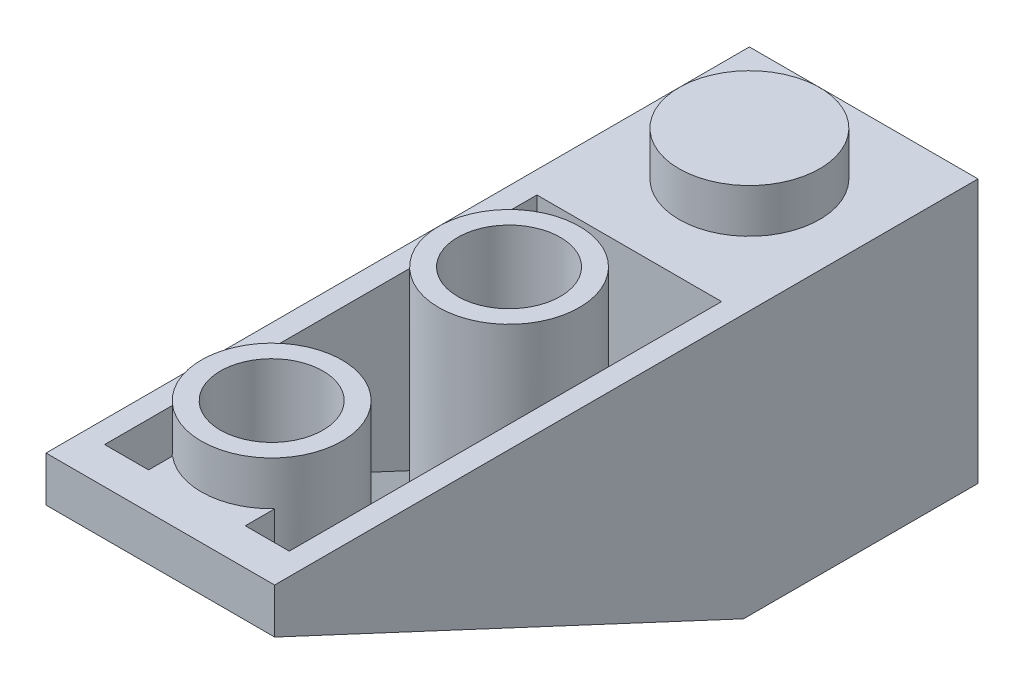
ISO-10303-21;
HEADER;
FILE_DESCRIPTION(('STEP AP214'),'2;1');
FILE_NAME('part.step','',(''),(''),'','','');
FILE_SCHEMA(('AUTOMOTIVE_DESIGN { 1 0 10303 214 1 1 1 1 }'));
ENDSEC;
DATA;
#1=APPLICATION_CONTEXT('core data for automotive mechanical design processes');
#2=APPLICATION_PROTOCOL_DEFINITION('international standard','automotive_design',2000,#1);
#3=PRODUCT_CONTEXT('',#1,'mechanical');
#4=PRODUCT('Part','Part','',(#3));
#5=PRODUCT_RELATED_PRODUCT_CATEGORY('part','',(#4));
#6=PRODUCT_DEFINITION_FORMATION('','',#4);
#7=PRODUCT_DEFINITION_CONTEXT('part definition',#1,'design');
#8=PRODUCT_DEFINITION('design','',#6,#7);
#9=PRODUCT_DEFINITION_SHAPE('','',#8);
#10=(LENGTH_UNIT() NAMED_UNIT(*) SI_UNIT(.MILLI.,.METRE.));
#11=(NAMED_UNIT(*) PLANE_ANGLE_UNIT() SI_UNIT($,.RADIAN.));
#12=(NAMED_UNIT(*) SI_UNIT($,.STERADIAN.) SOLID_ANGLE_UNIT());
#13=UNCERTAINTY_MEASURE_WITH_UNIT(LENGTH_MEASURE(1.E-05),#10,'distance_accuracy_value','');
#14=(GEOMETRIC_REPRESENTATION_CONTEXT(3) GLOBAL_UNCERTAINTY_ASSIGNED_CONTEXT((#13)) GLOBAL_UNIT_ASSIGNED_CONTEXT((#10,
#11,#12)) REPRESENTATION_CONTEXT('',''));
#15=CARTESIAN_POINT('',(0.,0.,0.));
#16=DIRECTION('',(0.,0.,1.));
#17=DIRECTION('',(1.,0.,0.));
#18=AXIS2_PLACEMENT_3D('',#15,#16,#17);
#19=CARTESIAN_POINT('',(-7.8,0.,24.));
#20=DIRECTION('',(0.,1.,0.));
#21=DIRECTION('',(0.,0.,1.));
#22=AXIS2_PLACEMENT_3D('',#19,#20,#21);
#23=PLANE('',#22);
#24=DIRECTION('',(0.,0.,1.));
#25=VECTOR('',#24,1.);
#26=CARTESIAN_POINT('',(-0.75,0.,24.));
#27=LINE('',#26,#25);
#28=CARTESIAN_POINT('',(-0.75,0.,8.));
#29=VERTEX_POINT('',#28);
#30=CARTESIAN_POINT('',(-0.75,0.,22.75));
#31=VERTEX_POINT('',#30);
#32=EDGE_CURVE('E189',#29,#31,#27,.T.);
#33=ORIENTED_EDGE('',*,*,#32,.T.);
#34=DIRECTION('',(-1.,0.,0.));
#35=VECTOR('',#34,1.);
#36=CARTESIAN_POINT('',(-7.05,0.,22.75));
#37=LINE('',#36,#35);
#38=CARTESIAN_POINT('',(-2.25,0.,22.75));
#39=VERTEX_POINT('',#38);
#40=EDGE_CURVE('E52',#31,#39,#37,.T.);
#41=ORIENTED_EDGE('',*,*,#40,.T.);
#42=DIRECTION('',(0.,0.,-1.));
#43=VECTOR('',#42,1.);
#44=CARTESIAN_POINT('',(-2.25,0.,21.7609382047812));
#45=LINE('',#44,#43);
#46=CARTESIAN_POINT('',(-2.25,0.,21.7609382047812));
#47=VERTEX_POINT('',#46);
#48=EDGE_CURVE('E301',#39,#47,#45,.T.);
#49=ORIENTED_EDGE('',*,*,#48,.T.);
#50=DIRECTION('',(-1.,0.,0.));
#51=VECTOR('',#50,1.);
#52=CARTESIAN_POINT('',(-2.25,0.,21.7609382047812));
#53=LINE('',#52,#51);
#54=CARTESIAN_POINT('',(-2.26757849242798,0.,21.7609382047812));
#55=VERTEX_POINT('',#54);
#56=EDGE_CURVE('E57',#47,#55,#53,.T.);
#57=ORIENTED_EDGE('',*,*,#56,.T.);
#58=CARTESIAN_POINT('',(-4.,0.,20.1));
#59=DIRECTION('',(0.,-1.,0.));
#60=DIRECTION('',(0.,0.,-1.));
#61=AXIS2_PLACEMENT_3D('',#58,#59,#60);
#62=CIRCLE('',#61,2.4);
#63=CARTESIAN_POINT('',(-5.55,0.,21.9323482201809));
#64=VERTEX_POINT('',#63);
#65=EDGE_CURVE('E312',#64,#55,#62,.F.);
#66=ORIENTED_EDGE('',*,*,#65,.F.);
#67=DIRECTION('',(0.,0.,1.));
#68=VECTOR('',#67,1.);
#69=CARTESIAN_POINT('',(-5.55,0.,21.7609382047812));
#70=LINE('',#69,#68);
#71=CARTESIAN_POINT('',(-5.55,0.,22.75));
#72=VERTEX_POINT('',#71);
#73=EDGE_CURVE('E275',#64,#72,#70,.T.);
#74=ORIENTED_EDGE('',*,*,#73,.T.);
#75=CARTESIAN_POINT('',(-7.05,0.,22.75));
#76=VERTEX_POINT('',#75);
#77=EDGE_CURVE('E182',#72,#76,#37,.T.);
#78=ORIENTED_EDGE('',*,*,#77,.T.);
#79=DIRECTION('',(0.,0.,-1.));
#80=VECTOR('',#79,1.);
#81=CARTESIAN_POINT('',(-7.05,0.,24.));
#82=LINE('',#81,#80);
#83=CARTESIAN_POINT('',(-7.05,0.,8.));
#84=VERTEX_POINT('',#83);
#85=EDGE_CURVE('E366',#76,#84,#82,.T.);
#86=ORIENTED_EDGE('',*,*,#85,.T.);
#87=DIRECTION('',(1.,0.,0.));
#88=VECTOR('',#87,1.);
#89=CARTESIAN_POINT('',(-7.8,0.,8.));
#90=LINE('',#89,#88);
#91=EDGE_CURVE('E196',#84,#29,#90,.T.);
#92=ORIENTED_EDGE('',*,*,#91,.T.);
#93=EDGE_LOOP('',(#33,#41,#49,#57,#66,#74,#78,#86,#92));
#94=FACE_BOUND('',#93,.T.);
#95=DIRECTION('',(0.,0.,1.));
#96=VECTOR('',#95,1.);
#97=CARTESIAN_POINT('',(-7.8,0.,8.));
#98=LINE('',#97,#96);
#99=CARTESIAN_POINT('',(-7.8,0.,0.));
#100=VERTEX_POINT('',#99);
#101=CARTESIAN_POINT('',(-7.8,0.,24.));
#102=VERTEX_POINT('',#101);
#103=EDGE_CURVE('E210',#100,#102,#98,.T.);
#104=ORIENTED_EDGE('',*,*,#103,.T.);
#105=DIRECTION('',(1.,0.,0.));
#106=VECTOR('',#105,1.);
#107=CARTESIAN_POINT('',(-7.8,0.,24.));
#108=LINE('',#107,#106);
#109=CARTESIAN_POINT('',(0.,0.,24.));
#110=VERTEX_POINT('',#109);
#111=EDGE_CURVE('E243',#102,#110,#108,.T.);
#112=ORIENTED_EDGE('',*,*,#111,.T.);
#113=DIRECTION('',(0.,0.,1.));
#114=VECTOR('',#113,1.);
#115=CARTESIAN_POINT('',(0.,0.,24.));
#116=LINE('',#115,#114);
#117=CARTESIAN_POINT('',(0.,0.,0.));
#118=VERTEX_POINT('',#117);
#119=EDGE_CURVE('E225',#118,#110,#116,.T.);
#120=ORIENTED_EDGE('',*,*,#119,.F.);
#121=DIRECTION('',(1.,0.,0.));
#122=VECTOR('',#121,1.);
#123=CARTESIAN_POINT('',(-7.8,0.,0.));
#124=LINE('',#123,#122);
#125=EDGE_CURVE('E222',#100,#118,#124,.T.);
#126=ORIENTED_EDGE('',*,*,#125,.F.);
#127=EDGE_LOOP('',(#104,#112,#120,#126));
#128=FACE_BOUND('',#127,.T.);
#129=CARTESIAN_POINT('',(-3.9,0.,3.9));
#130=DIRECTION('',(0.,1.,0.));
#131=DIRECTION('',(0.,0.,1.));
#132=AXIS2_PLACEMENT_3D('',#129,#130,#131);
#133=CIRCLE('',#132,2.4);
#134=CARTESIAN_POINT('',(-3.9,0.,6.3));
#135=VERTEX_POINT('',#134);
#136=EDGE_CURVE('E334',#135,#135,#133,.T.);
#137=ORIENTED_EDGE('',*,*,#136,.F.);
#138=EDGE_LOOP('',(#137));
#139=FACE_BOUND('',#138,.T.);
#140=ADVANCED_FACE('F37',(#94,#128,#139),#23,.T.);
#141=CARTESIAN_POINT('',(-7.8,-8.00000000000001,8.));
#142=DIRECTION('',(0.,0.90630778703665,-0.422618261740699));
#143=DIRECTION('',(0.,0.422618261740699,0.90630778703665));
#144=AXIS2_PLACEMENT_3D('',#141,#142,#143);
#145=PLANE('',#144);
#146=DIRECTION('',(1.,0.,0.));
#147=VECTOR('',#146,1.);
#148=CARTESIAN_POINT('',(-7.05,-1.12196204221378,22.75));
#149=LINE('',#148,#147);
#150=CARTESIAN_POINT('',(-2.25,-1.12196204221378,22.75));
#151=VERTEX_POINT('',#150);
#152=CARTESIAN_POINT('',(-0.75,-1.12196204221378,22.75));
#153=VERTEX_POINT('',#152);
#154=EDGE_CURVE('E382',#151,#153,#149,.T.);
#155=ORIENTED_EDGE('',*,*,#154,.T.);
#156=DIRECTION('',(0.,-0.422618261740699,-0.90630778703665));
#157=VECTOR('',#156,1.);
#158=CARTESIAN_POINT('',(-0.75,-8.00000000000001,8.));
#159=LINE('',#158,#157);
#160=CARTESIAN_POINT('',(-0.75,-8.00000000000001,8.));
#161=VERTEX_POINT('',#160);
#162=EDGE_CURVE('E191',#153,#161,#159,.T.);
#163=ORIENTED_EDGE('',*,*,#162,.T.);
#164=DIRECTION('',(1.,0.,0.));
#165=VECTOR('',#164,1.);
#166=CARTESIAN_POINT('',(-7.8,-8.00000000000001,8.));
#167=LINE('',#166,#165);
#168=CARTESIAN_POINT('',(-7.05,-8.00000000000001,8.));
#169=VERTEX_POINT('',#168);
#170=EDGE_CURVE('E245',#169,#161,#167,.T.);
#171=ORIENTED_EDGE('',*,*,#170,.F.);
#172=DIRECTION('',(0.,-0.422618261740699,-0.90630778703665));
#173=VECTOR('',#172,1.);
#174=CARTESIAN_POINT('',(-7.05,-8.00000000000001,8.));
#175=LINE('',#174,#173);
#176=CARTESIAN_POINT('',(-7.05,-1.12196204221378,22.75));
#177=VERTEX_POINT('',#176);
#178=EDGE_CURVE('E198',#177,#169,#175,.T.);
#179=ORIENTED_EDGE('',*,*,#178,.F.);
#180=CARTESIAN_POINT('',(-5.55,-1.12196204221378,22.75));
#181=VERTEX_POINT('',#180);
#182=EDGE_CURVE('E291',#177,#181,#149,.T.);
#183=ORIENTED_EDGE('',*,*,#182,.T.);
#184=DIRECTION('',(0.,-0.422618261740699,-0.90630778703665));
#185=VECTOR('',#184,1.);
#186=CARTESIAN_POINT('',(-5.55,-2.21627286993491,20.4032428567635));
#187=LINE('',#186,#185);
#188=CARTESIAN_POINT('',(-5.55,-1.50323932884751,21.9323482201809));
#189=VERTEX_POINT('',#188);
#190=EDGE_CURVE('E273',#181,#189,#187,.T.);
#191=ORIENTED_EDGE('',*,*,#190,.T.);
#192=CARTESIAN_POINT('',(-4.,-2.35767733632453,20.1));
#193=DIRECTION('',(0.,0.90630778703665,-0.422618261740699));
#194=DIRECTION('',(0.,0.422618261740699,0.90630778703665));
#195=AXIS2_PLACEMENT_3D('',#192,#193,#194);
#196=ELLIPSE('',#195,2.64810700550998,2.4);
#197=CARTESIAN_POINT('',(-2.26757849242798,-1.58316913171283,21.7609382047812));
#198=VERTEX_POINT('',#197);
#199=EDGE_CURVE('E252',#198,#189,#196,.T.);
#200=ORIENTED_EDGE('',*,*,#199,.F.);
#201=DIRECTION('',(1.,0.,0.));
#202=VECTOR('',#201,1.);
#203=CARTESIAN_POINT('',(-2.25,-1.58316913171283,21.7609382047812));
#204=LINE('',#203,#202);
#205=CARTESIAN_POINT('',(-2.25,-1.58316913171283,21.7609382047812));
#206=VERTEX_POINT('',#205);
#207=EDGE_CURVE('E288',#198,#206,#204,.T.);
#208=ORIENTED_EDGE('',*,*,#207,.T.);
#209=DIRECTION('',(0.,0.422618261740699,0.90630778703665));
#210=VECTOR('',#209,1.);
#211=CARTESIAN_POINT('',(-2.25,-2.21627286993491,20.4032428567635));
#212=LINE('',#211,#210);
#213=EDGE_CURVE('E296',#206,#151,#212,.T.);
#214=ORIENTED_EDGE('',*,*,#213,.T.);
#215=EDGE_LOOP('',(#155,#163,#171,#179,#183,#191,#200,#208,#214));
#216=FACE_BOUND('',#215,.T.);
#217=CARTESIAN_POINT('',(-3.9,-6.08784714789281,12.100625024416));
#218=DIRECTION('',(0.,0.90630778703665,-0.422618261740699));
#219=DIRECTION('',(0.,0.422618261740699,0.90630778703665));
#220=AXIS2_PLACEMENT_3D('',#217,#218,#219);
#221=ELLIPSE('',#220,2.64810700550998,2.4);
#222=CARTESIAN_POINT('',(-3.9,-4.96870876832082,14.500625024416));
#223=VERTEX_POINT('',#222);
#224=EDGE_CURVE('E238',#223,#223,#221,.T.);
#225=ORIENTED_EDGE('',*,*,#224,.F.);
#226=EDGE_LOOP('',(#225));
#227=FACE_BOUND('',#226,.T.);
#228=ADVANCED_FACE('F285',(#216,#227),#145,.T.);
#229=CARTESIAN_POINT('',(-7.8,-8.00000000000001,8.));
#230=DIRECTION('',(0.,0.,1.));
#231=DIRECTION('',(0.,-1.,0.));
#232=AXIS2_PLACEMENT_3D('',#229,#230,#231);
#233=PLANE('',#232);
#234=DIRECTION('',(0.,1.,0.));
#235=VECTOR('',#234,1.);
#236=CARTESIAN_POINT('',(-7.05,-8.00000000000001,8.));
#237=LINE('',#236,#235);
#238=EDGE_CURVE('E201',#169,#84,#237,.T.);
#239=ORIENTED_EDGE('',*,*,#238,.F.);
#240=ORIENTED_EDGE('',*,*,#170,.T.);
#241=DIRECTION('',(0.,1.,0.));
#242=VECTOR('',#241,1.);
#243=CARTESIAN_POINT('',(-0.75,-8.00000000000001,8.));
#244=LINE('',#243,#242);
#245=EDGE_CURVE('E197',#161,#29,#244,.T.);
#246=ORIENTED_EDGE('',*,*,#245,.T.);
#247=ORIENTED_EDGE('',*,*,#91,.F.);
#248=EDGE_LOOP('',(#239,#240,#246,#247));
#249=FACE_BOUND('',#248,.T.);
#250=ADVANCED_FACE('F381',(#249),#233,.T.);
#251=CARTESIAN_POINT('',(-7.8,0.,0.));
#252=DIRECTION('',(0.,0.,-1.));
#253=DIRECTION('',(0.,1.,0.));
#254=AXIS2_PLACEMENT_3D('',#251,#252,#253);
#255=PLANE('',#254);
#256=DIRECTION('',(0.,1.,0.));
#257=VECTOR('',#256,1.);
#258=CARTESIAN_POINT('',(0.,0.,0.));
#259=LINE('',#258,#257);
#260=CARTESIAN_POINT('',(0.,-9.,0.));
#261=VERTEX_POINT('',#260);
#262=EDGE_CURVE('E206',#261,#118,#259,.T.);
#263=ORIENTED_EDGE('',*,*,#262,.F.);
#264=DIRECTION('',(1.,0.,0.));
#265=VECTOR('',#264,1.);
#266=CARTESIAN_POINT('',(-7.8,-9.,0.));
#267=LINE('',#266,#265);
#268=CARTESIAN_POINT('',(-7.8,-9.,0.));
#269=VERTEX_POINT('',#268);
#270=EDGE_CURVE('E236',#269,#261,#267,.T.);
#271=ORIENTED_EDGE('',*,*,#270,.F.);
#272=DIRECTION('',(0.,1.,0.));
#273=VECTOR('',#272,1.);
#274=CARTESIAN_POINT('',(-7.8,0.,0.));
#275=LINE('',#274,#273);
#276=EDGE_CURVE('E207',#269,#100,#275,.T.);
#277=ORIENTED_EDGE('',*,*,#276,.T.);
#278=ORIENTED_EDGE('',*,*,#125,.T.);
#279=EDGE_LOOP('',(#263,#271,#277,#278));
#280=FACE_BOUND('',#279,.T.);
#281=ADVANCED_FACE('F39',(#280),#255,.T.);
#282=CARTESIAN_POINT('',(-7.8,-9.,0.));
#283=DIRECTION('',(0.,-1.,0.));
#284=DIRECTION('',(0.,0.,-1.));
#285=AXIS2_PLACEMENT_3D('',#282,#283,#284);
#286=PLANE('',#285);
#287=DIRECTION('',(0.,0.,1.));
#288=VECTOR('',#287,1.);
#289=CARTESIAN_POINT('',(-1.45,-9.,6.55));
#290=LINE('',#289,#288);
#291=CARTESIAN_POINT('',(-1.45,-9.,1.45));
#292=VERTEX_POINT('',#291);
#293=CARTESIAN_POINT('',(-1.45,-9.,6.55));
#294=VERTEX_POINT('',#293);
#295=EDGE_CURVE('E338',#292,#294,#290,.T.);
#296=ORIENTED_EDGE('',*,*,#295,.F.);
#297=DIRECTION('',(1.,0.,0.));
#298=VECTOR('',#297,1.);
#299=CARTESIAN_POINT('',(-1.45,-9.,1.45));
#300=LINE('',#299,#298);
#301=CARTESIAN_POINT('',(-6.35,-9.,1.45));
#302=VERTEX_POINT('',#301);
#303=EDGE_CURVE('E345',#302,#292,#300,.T.);
#304=ORIENTED_EDGE('',*,*,#303,.F.);
#305=DIRECTION('',(0.,0.,-1.));
#306=VECTOR('',#305,1.);
#307=CARTESIAN_POINT('',(-6.35,-9.,6.55));
#308=LINE('',#307,#306);
#309=CARTESIAN_POINT('',(-6.35,-9.,6.55));
#310=VERTEX_POINT('',#309);
#311=EDGE_CURVE('E359',#310,#302,#308,.T.);
#312=ORIENTED_EDGE('',*,*,#311,.F.);
#313=DIRECTION('',(-1.,0.,0.));
#314=VECTOR('',#313,1.);
#315=CARTESIAN_POINT('',(-1.45,-9.,6.55));
#316=LINE('',#315,#314);
#317=EDGE_CURVE('E356',#294,#310,#316,.T.);
#318=ORIENTED_EDGE('',*,*,#317,.F.);
#319=EDGE_LOOP('',(#296,#304,#312,#318));
#320=FACE_BOUND('',#319,.T.);
#321=DIRECTION('',(0.,0.,-1.));
#322=VECTOR('',#321,1.);
#323=CARTESIAN_POINT('',(0.,-9.,0.));
#324=LINE('',#323,#322);
#325=CARTESIAN_POINT('',(0.,-9.,8.));
#326=VERTEX_POINT('',#325);
#327=EDGE_CURVE('E211',#326,#261,#324,.T.);
#328=ORIENTED_EDGE('',*,*,#327,.F.);
#329=DIRECTION('',(1.,0.,0.));
#330=VECTOR('',#329,1.);
#331=CARTESIAN_POINT('',(-7.8,-9.,8.));
#332=LINE('',#331,#330);
#333=CARTESIAN_POINT('',(-7.8,-9.,8.));
#334=VERTEX_POINT('',#333);
#335=EDGE_CURVE('E239',#334,#326,#332,.T.);
#336=ORIENTED_EDGE('',*,*,#335,.F.);
#337=DIRECTION('',(0.,0.,-1.));
#338=VECTOR('',#337,1.);
#339=CARTESIAN_POINT('',(-7.8,-9.,0.));
#340=LINE('',#339,#338);
#341=EDGE_CURVE('E219',#334,#269,#340,.T.);
#342=ORIENTED_EDGE('',*,*,#341,.T.);
#343=ORIENTED_EDGE('',*,*,#270,.T.);
#344=EDGE_LOOP('',(#328,#336,#342,#343));
#345=FACE_BOUND('',#344,.T.);
#346=ADVANCED_FACE('F411',(#320,#345),#286,.T.);
#347=CARTESIAN_POINT('',(-7.8,-9.,8.));
#348=DIRECTION('',(0.,-0.90630778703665,0.422618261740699));
#349=DIRECTION('',(0.,-0.422618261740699,-0.90630778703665));
#350=AXIS2_PLACEMENT_3D('',#347,#348,#349);
#351=PLANE('',#350);
#352=CARTESIAN_POINT('',(-3.9,-7.13476936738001,12.));
#353=DIRECTION('',(0.,-0.90630778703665,0.422618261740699));
#354=DIRECTION('',(0.,-0.422618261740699,-0.90630778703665));
#355=AXIS2_PLACEMENT_3D('',#352,#353,#354);
#356=ELLIPSE('',#355,2.64810700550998,2.4);
#357=CARTESIAN_POINT('',(-6.16859773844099,-7.5,11.2167603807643));
#358=VERTEX_POINT('',#357);
#359=CARTESIAN_POINT('',(-1.63140226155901,-7.5,11.2167603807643));
#360=VERTEX_POINT('',#359);
#361=EDGE_CURVE('E258',#358,#360,#356,.T.);
#362=ORIENTED_EDGE('',*,*,#361,.F.);
#363=DIRECTION('',(1.,0.,0.));
#364=VECTOR('',#363,1.);
#365=CARTESIAN_POINT('',(-7.8,-7.5,11.2167603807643));
#366=LINE('',#365,#364);
#367=EDGE_CURVE('E255',#358,#360,#366,.T.);
#368=ORIENTED_EDGE('',*,*,#367,.T.);
#369=EDGE_LOOP('',(#362,#368));
#370=FACE_BOUND('',#369,.T.);
#371=DIRECTION('',(0.,-0.422618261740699,-0.90630778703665));
#372=VECTOR('',#371,1.);
#373=CARTESIAN_POINT('',(0.,-9.,8.));
#374=LINE('',#373,#372);
#375=CARTESIAN_POINT('',(0.,-1.53907746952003,24.));
#376=VERTEX_POINT('',#375);
#377=EDGE_CURVE('E231',#376,#326,#374,.T.);
#378=ORIENTED_EDGE('',*,*,#377,.F.);
#379=DIRECTION('',(1.,0.,0.));
#380=VECTOR('',#379,1.);
#381=CARTESIAN_POINT('',(-7.8,-1.53907746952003,24.));
#382=LINE('',#381,#380);
#383=CARTESIAN_POINT('',(-7.8,-1.53907746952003,24.));
#384=VERTEX_POINT('',#383);
#385=EDGE_CURVE('E241',#384,#376,#382,.T.);
#386=ORIENTED_EDGE('',*,*,#385,.F.);
#387=DIRECTION('',(0.,-0.422618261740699,-0.90630778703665));
#388=VECTOR('',#387,1.);
#389=CARTESIAN_POINT('',(-7.8,-9.,8.));
#390=LINE('',#389,#388);
#391=EDGE_CURVE('E216',#384,#334,#390,.T.);
#392=ORIENTED_EDGE('',*,*,#391,.T.);
#393=ORIENTED_EDGE('',*,*,#335,.T.);
#394=EDGE_LOOP('',(#378,#386,#392,#393));
#395=FACE_BOUND('',#394,.T.);
#396=ADVANCED_FACE('F416',(#370,#395),#351,.T.);
#397=CARTESIAN_POINT('',(-7.8,0.,24.));
#398=DIRECTION('',(0.,0.,1.));
#399=DIRECTION('',(1.,0.,0.));
#400=AXIS2_PLACEMENT_3D('',#397,#398,#399);
#401=PLANE('',#400);
#402=DIRECTION('',(0.,-1.,0.));
#403=VECTOR('',#402,1.);
#404=CARTESIAN_POINT('',(0.,0.,24.));
#405=LINE('',#404,#403);
#406=EDGE_CURVE('E228',#110,#376,#405,.T.);
#407=ORIENTED_EDGE('',*,*,#406,.F.);
#408=ORIENTED_EDGE('',*,*,#111,.F.);
#409=DIRECTION('',(0.,-1.,0.));
#410=VECTOR('',#409,1.);
#411=CARTESIAN_POINT('',(-7.8,0.,24.));
#412=LINE('',#411,#410);
#413=EDGE_CURVE('E213',#102,#384,#412,.T.);
#414=ORIENTED_EDGE('',*,*,#413,.T.);
#415=ORIENTED_EDGE('',*,*,#385,.T.);
#416=EDGE_LOOP('',(#407,#408,#414,#415));
#417=FACE_BOUND('',#416,.T.);
#418=ADVANCED_FACE('F405',(#417),#401,.T.);
#419=CARTESIAN_POINT('',(-7.8,0.,0.));
#420=DIRECTION('',(1.,0.,0.));
#421=DIRECTION('',(0.,0.,-1.));
#422=AXIS2_PLACEMENT_3D('',#419,#420,#421);
#423=PLANE('',#422);
#424=ORIENTED_EDGE('',*,*,#413,.F.);
#425=ORIENTED_EDGE('',*,*,#103,.F.);
#426=ORIENTED_EDGE('',*,*,#276,.F.);
#427=ORIENTED_EDGE('',*,*,#341,.F.);
#428=ORIENTED_EDGE('',*,*,#391,.F.);
#429=EDGE_LOOP('',(#424,#425,#426,#427,#428));
#430=FACE_BOUND('',#429,.T.);
#431=ADVANCED_FACE('F431',(#430),#423,.F.);
#432=CARTESIAN_POINT('',(0.,0.,0.));
#433=DIRECTION('',(1.,0.,0.));
#434=DIRECTION('',(0.,0.,-1.));
#435=AXIS2_PLACEMENT_3D('',#432,#433,#434);
#436=PLANE('',#435);
#437=ORIENTED_EDGE('',*,*,#262,.T.);
#438=ORIENTED_EDGE('',*,*,#119,.T.);
#439=ORIENTED_EDGE('',*,*,#406,.T.);
#440=ORIENTED_EDGE('',*,*,#377,.T.);
#441=ORIENTED_EDGE('',*,*,#327,.T.);
#442=EDGE_LOOP('',(#437,#438,#439,#440,#441));
#443=FACE_BOUND('',#442,.T.);
#444=ADVANCED_FACE('F424',(#443),#436,.T.);
#445=CARTESIAN_POINT('',(-0.75,-9.,24.));
#446=DIRECTION('',(1.,0.,0.));
#447=DIRECTION('',(0.,0.,-1.));
#448=AXIS2_PLACEMENT_3D('',#445,#446,#447);
#449=PLANE('',#448);
#450=ORIENTED_EDGE('',*,*,#162,.F.);
#451=DIRECTION('',(0.,1.,0.));
#452=VECTOR('',#451,1.);
#453=CARTESIAN_POINT('',(-0.75,-7.69452868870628,22.75));
#454=LINE('',#453,#452);
#455=EDGE_CURVE('E178',#153,#31,#454,.T.);
#456=ORIENTED_EDGE('',*,*,#455,.T.);
#457=ORIENTED_EDGE('',*,*,#32,.F.);
#458=ORIENTED_EDGE('',*,*,#245,.F.);
#459=EDGE_LOOP('',(#450,#456,#457,#458));
#460=FACE_BOUND('',#459,.T.);
#461=ADVANCED_FACE('F187',(#460),#449,.F.);
#462=CARTESIAN_POINT('',(-7.05,-9.,24.));
#463=DIRECTION('',(1.,0.,0.));
#464=DIRECTION('',(0.,0.,-1.));
#465=AXIS2_PLACEMENT_3D('',#462,#463,#464);
#466=PLANE('',#465);
#467=DIRECTION('',(0.,1.,0.));
#468=VECTOR('',#467,1.);
#469=CARTESIAN_POINT('',(-7.05,-7.69452868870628,22.75));
#470=LINE('',#469,#468);
#471=EDGE_CURVE('E192',#177,#76,#470,.T.);
#472=ORIENTED_EDGE('',*,*,#471,.F.);
#473=ORIENTED_EDGE('',*,*,#178,.T.);
#474=ORIENTED_EDGE('',*,*,#238,.T.);
#475=ORIENTED_EDGE('',*,*,#85,.F.);
#476=EDGE_LOOP('',(#472,#473,#474,#475));
#477=FACE_BOUND('',#476,.T.);
#478=ADVANCED_FACE('F378',(#477),#466,.T.);
#479=CARTESIAN_POINT('',(-1.45,-1.,6.55));
#480=DIRECTION('',(1.,0.,0.));
#481=DIRECTION('',(0.,0.,-1.));
#482=AXIS2_PLACEMENT_3D('',#479,#480,#481);
#483=PLANE('',#482);
#484=ORIENTED_EDGE('',*,*,#295,.T.);
#485=DIRECTION('',(0.,-1.,0.));
#486=VECTOR('',#485,1.);
#487=CARTESIAN_POINT('',(-1.45,-1.,6.55));
#488=LINE('',#487,#486);
#489=CARTESIAN_POINT('',(-1.45,-1.,6.55));
#490=VERTEX_POINT('',#489);
#491=EDGE_CURVE('E354',#490,#294,#488,.T.);
#492=ORIENTED_EDGE('',*,*,#491,.F.);
#493=DIRECTION('',(0.,0.,1.));
#494=VECTOR('',#493,1.);
#495=CARTESIAN_POINT('',(-1.45,-1.,6.55));
#496=LINE('',#495,#494);
#497=CARTESIAN_POINT('',(-1.45,-1.,1.45));
#498=VERTEX_POINT('',#497);
#499=EDGE_CURVE('E341',#498,#490,#496,.T.);
#500=ORIENTED_EDGE('',*,*,#499,.F.);
#501=DIRECTION('',(0.,-1.,0.));
#502=VECTOR('',#501,1.);
#503=CARTESIAN_POINT('',(-1.45,-1.,1.45));
#504=LINE('',#503,#502);
#505=EDGE_CURVE('E364',#498,#292,#504,.T.);
#506=ORIENTED_EDGE('',*,*,#505,.T.);
#507=EDGE_LOOP('',(#484,#492,#500,#506));
#508=FACE_BOUND('',#507,.T.);
#509=ADVANCED_FACE('F453',(#508),#483,.F.);
#510=CARTESIAN_POINT('',(-1.45,-1.,1.45));
#511=DIRECTION('',(0.,0.,-1.));
#512=DIRECTION('',(0.,1.,0.));
#513=AXIS2_PLACEMENT_3D('',#510,#511,#512);
#514=PLANE('',#513);
#515=ORIENTED_EDGE('',*,*,#303,.T.);
#516=ORIENTED_EDGE('',*,*,#505,.F.);
#517=DIRECTION('',(1.,0.,0.));
#518=VECTOR('',#517,1.);
#519=CARTESIAN_POINT('',(-1.45,-1.,1.45));
#520=LINE('',#519,#518);
#521=CARTESIAN_POINT('',(-6.35,-1.,1.45));
#522=VERTEX_POINT('',#521);
#523=EDGE_CURVE('E351',#522,#498,#520,.T.);
#524=ORIENTED_EDGE('',*,*,#523,.F.);
#525=DIRECTION('',(0.,-1.,0.));
#526=VECTOR('',#525,1.);
#527=CARTESIAN_POINT('',(-6.35,-1.,1.45));
#528=LINE('',#527,#526);
#529=EDGE_CURVE('E367',#522,#302,#528,.T.);
#530=ORIENTED_EDGE('',*,*,#529,.T.);
#531=EDGE_LOOP('',(#515,#516,#524,#530));
#532=FACE_BOUND('',#531,.T.);
#533=ADVANCED_FACE('F456',(#532),#514,.F.);
#534=CARTESIAN_POINT('',(-6.35,-1.,6.55));
#535=DIRECTION('',(-1.,0.,0.));
#536=DIRECTION('',(0.,0.,1.));
#537=AXIS2_PLACEMENT_3D('',#534,#535,#536);
#538=PLANE('',#537);
#539=ORIENTED_EDGE('',*,*,#311,.T.);
#540=ORIENTED_EDGE('',*,*,#529,.F.);
#541=DIRECTION('',(0.,0.,-1.));
#542=VECTOR('',#541,1.);
#543=CARTESIAN_POINT('',(-6.35,-1.,6.55));
#544=LINE('',#543,#542);
#545=CARTESIAN_POINT('',(-6.35,-1.,6.55));
#546=VERTEX_POINT('',#545);
#547=EDGE_CURVE('E348',#546,#522,#544,.T.);
#548=ORIENTED_EDGE('',*,*,#547,.F.);
#549=DIRECTION('',(0.,-1.,0.));
#550=VECTOR('',#549,1.);
#551=CARTESIAN_POINT('',(-6.35,-1.,6.55));
#552=LINE('',#551,#550);
#553=EDGE_CURVE('E369',#546,#310,#552,.T.);
#554=ORIENTED_EDGE('',*,*,#553,.T.);
#555=EDGE_LOOP('',(#539,#540,#548,#554));
#556=FACE_BOUND('',#555,.T.);
#557=ADVANCED_FACE('F462',(#556),#538,.F.);
#558=CARTESIAN_POINT('',(-1.45,-1.,6.55));
#559=DIRECTION('',(0.,0.,1.));
#560=DIRECTION('',(0.,-1.,0.));
#561=AXIS2_PLACEMENT_3D('',#558,#559,#560);
#562=PLANE('',#561);
#563=ORIENTED_EDGE('',*,*,#317,.T.);
#564=ORIENTED_EDGE('',*,*,#553,.F.);
#565=DIRECTION('',(-1.,0.,0.));
#566=VECTOR('',#565,1.);
#567=CARTESIAN_POINT('',(-1.45,-1.,6.55));
#568=LINE('',#567,#566);
#569=EDGE_CURVE('E344',#490,#546,#568,.T.);
#570=ORIENTED_EDGE('',*,*,#569,.F.);
#571=ORIENTED_EDGE('',*,*,#491,.T.);
#572=EDGE_LOOP('',(#563,#564,#570,#571));
#573=FACE_BOUND('',#572,.T.);
#574=ADVANCED_FACE('F458',(#573),#562,.F.);
#575=CARTESIAN_POINT('',(-1.45,-1.,1.45));
#576=DIRECTION('',(0.,1.,0.));
#577=DIRECTION('',(0.,0.,1.));
#578=AXIS2_PLACEMENT_3D('',#575,#576,#577);
#579=PLANE('',#578);
#580=ORIENTED_EDGE('',*,*,#499,.T.);
#581=ORIENTED_EDGE('',*,*,#569,.T.);
#582=ORIENTED_EDGE('',*,*,#547,.T.);
#583=ORIENTED_EDGE('',*,*,#523,.T.);
#584=EDGE_LOOP('',(#580,#581,#582,#583));
#585=FACE_BOUND('',#584,.T.);
#586=ADVANCED_FACE('F461',(#585),#579,.F.);
#587=CARTESIAN_POINT('',(-3.9,1.5,3.9));
#588=DIRECTION('',(0.,-1.,0.));
#589=DIRECTION('',(0.,0.,-1.));
#590=AXIS2_PLACEMENT_3D('',#587,#588,#589);
#591=CYLINDRICAL_SURFACE('',#590,2.4);
#592=CARTESIAN_POINT('',(-3.9,1.5,3.9));
#593=DIRECTION('',(0.,1.,0.));
#594=DIRECTION('',(0.,0.,1.));
#595=AXIS2_PLACEMENT_3D('',#592,#593,#594);
#596=CIRCLE('',#595,2.4);
#597=CARTESIAN_POINT('',(-3.9,1.5,6.3));
#598=VERTEX_POINT('',#597);
#599=EDGE_CURVE('E335',#598,#598,#596,.T.);
#600=ORIENTED_EDGE('',*,*,#599,.F.);
#601=EDGE_LOOP('',(#600));
#602=FACE_BOUND('',#601,.T.);
#603=ORIENTED_EDGE('',*,*,#136,.T.);
#604=EDGE_LOOP('',(#603));
#605=FACE_BOUND('',#604,.T.);
#606=ADVANCED_FACE('F472',(#602,#605),#591,.T.);
#607=CARTESIAN_POINT('',(-3.9,1.5,3.9));
#608=DIRECTION('',(0.,1.,0.));
#609=DIRECTION('',(0.,0.,1.));
#610=AXIS2_PLACEMENT_3D('',#607,#608,#609);
#611=PLANE('',#610);
#612=ORIENTED_EDGE('',*,*,#599,.T.);
#613=EDGE_LOOP('',(#612));
#614=FACE_BOUND('',#613,.T.);
#615=ADVANCED_FACE('F476',(#614),#611,.T.);
#616=CARTESIAN_POINT('',(-3.9,-13.2269485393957,12.100625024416));
#617=DIRECTION('',(0.,1.,0.));
#618=DIRECTION('',(0.,0.,1.));
#619=AXIS2_PLACEMENT_3D('',#616,#617,#618);
#620=CYLINDRICAL_SURFACE('',#619,2.4);
#621=ORIENTED_EDGE('',*,*,#224,.T.);
#622=EDGE_LOOP('',(#621));
#623=FACE_BOUND('',#622,.T.);
#624=CARTESIAN_POINT('',(-3.9,1.5,12.100625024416));
#625=DIRECTION('',(0.,1.,0.));
#626=DIRECTION('',(0.,0.,1.));
#627=AXIS2_PLACEMENT_3D('',#624,#625,#626);
#628=CIRCLE('',#627,2.4);
#629=CARTESIAN_POINT('',(-3.9,1.5,14.500625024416));
#630=VERTEX_POINT('',#629);
#631=EDGE_CURVE('E328',#630,#630,#628,.T.);
#632=ORIENTED_EDGE('',*,*,#631,.F.);
#633=EDGE_LOOP('',(#632));
#634=FACE_BOUND('',#633,.T.);
#635=ADVANCED_FACE('F480',(#623,#634),#620,.T.);
#636=CARTESIAN_POINT('',(-3.9,1.5,12.100625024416));
#637=DIRECTION('',(0.,1.,0.));
#638=DIRECTION('',(0.,0.,1.));
#639=AXIS2_PLACEMENT_3D('',#636,#637,#638);
#640=PLANE('',#639);
#641=CARTESIAN_POINT('',(-3.9,1.5,12.100625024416));
#642=DIRECTION('',(0.,1.,0.));
#643=DIRECTION('',(0.,0.,1.));
#644=AXIS2_PLACEMENT_3D('',#641,#642,#643);
#645=CIRCLE('',#644,1.75);
#646=CARTESIAN_POINT('',(-3.9,1.5,13.850625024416));
#647=VERTEX_POINT('',#646);
#648=EDGE_CURVE('E325',#647,#647,#645,.T.);
#649=ORIENTED_EDGE('',*,*,#648,.F.);
#650=EDGE_LOOP('',(#649));
#651=FACE_BOUND('',#650,.T.);
#652=ORIENTED_EDGE('',*,*,#631,.T.);
#653=EDGE_LOOP('',(#652));
#654=FACE_BOUND('',#653,.T.);
#655=ADVANCED_FACE('F484',(#651,#654),#640,.T.);
#656=CARTESIAN_POINT('',(-3.9,-13.2269485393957,12.100625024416));
#657=DIRECTION('',(0.,1.,0.));
#658=DIRECTION('',(0.,0.,1.));
#659=AXIS2_PLACEMENT_3D('',#656,#657,#658);
#660=CYLINDRICAL_SURFACE('',#659,1.75);
#661=CARTESIAN_POINT('',(-3.9,-6.08784714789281,12.100625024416));
#662=DIRECTION('',(0.,0.90630778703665,-0.422618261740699));
#663=DIRECTION('',(0.,0.422618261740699,0.90630778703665));
#664=AXIS2_PLACEMENT_3D('',#661,#662,#663);
#665=ELLIPSE('',#664,1.93091135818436,1.75);
#666=CARTESIAN_POINT('',(-3.9,-5.27180874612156,13.850625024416));
#667=VERTEX_POINT('',#666);
#668=EDGE_CURVE('E331',#667,#667,#665,.F.);
#669=ORIENTED_EDGE('',*,*,#668,.T.);
#670=EDGE_LOOP('',(#669));
#671=FACE_BOUND('',#670,.T.);
#672=ORIENTED_EDGE('',*,*,#648,.T.);
#673=EDGE_LOOP('',(#672));
#674=FACE_BOUND('',#673,.T.);
#675=ADVANCED_FACE('F488',(#671,#674),#660,.F.);
#676=ORIENTED_EDGE('',*,*,#668,.F.);
#677=EDGE_LOOP('',(#676));
#678=FACE_BOUND('',#677,.T.);
#679=ADVANCED_FACE('F403',(#678),#145,.T.);
#680=CARTESIAN_POINT('',(-4.,-13.2269485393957,20.1));
#681=DIRECTION('',(0.,1.,0.));
#682=DIRECTION('',(0.,0.,1.));
#683=AXIS2_PLACEMENT_3D('',#680,#681,#682);
#684=CYLINDRICAL_SURFACE('',#683,2.4);
#685=DIRECTION('',(0.,1.,0.));
#686=VECTOR('',#685,1.);
#687=CARTESIAN_POINT('',(-5.55,-13.2269485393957,21.9323482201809));
#688=LINE('',#687,#686);
#689=EDGE_CURVE('E45',#64,#189,#688,.F.);
#690=ORIENTED_EDGE('',*,*,#689,.F.);
#691=ORIENTED_EDGE('',*,*,#65,.T.);
#692=DIRECTION('',(0.,1.,0.));
#693=VECTOR('',#692,1.);
#694=CARTESIAN_POINT('',(-2.26757849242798,-13.2269485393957,21.7609382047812));
#695=LINE('',#694,#693);
#696=EDGE_CURVE('E282',#198,#55,#695,.T.);
#697=ORIENTED_EDGE('',*,*,#696,.F.);
#698=ORIENTED_EDGE('',*,*,#199,.T.);
#699=EDGE_LOOP('',(#690,#691,#697,#698));
#700=FACE_BOUND('',#699,.T.);
#701=CARTESIAN_POINT('',(-4.,1.5,20.1));
#702=DIRECTION('',(0.,1.,0.));
#703=DIRECTION('',(0.,0.,1.));
#704=AXIS2_PLACEMENT_3D('',#701,#702,#703);
#705=CIRCLE('',#704,2.4);
#706=CARTESIAN_POINT('',(-4.,1.5,22.5));
#707=VERTEX_POINT('',#706);
#708=EDGE_CURVE('E319',#707,#707,#705,.T.);
#709=ORIENTED_EDGE('',*,*,#708,.F.);
#710=EDGE_LOOP('',(#709));
#711=FACE_BOUND('',#710,.T.);
#712=ADVANCED_FACE('F280',(#700,#711),#684,.T.);
#713=CARTESIAN_POINT('',(-4.,1.5,20.1));
#714=DIRECTION('',(0.,1.,0.));
#715=DIRECTION('',(0.,0.,1.));
#716=AXIS2_PLACEMENT_3D('',#713,#714,#715);
#717=PLANE('',#716);
#718=CARTESIAN_POINT('',(-4.,1.5,20.1));
#719=DIRECTION('',(0.,1.,0.));
#720=DIRECTION('',(0.,0.,1.));
#721=AXIS2_PLACEMENT_3D('',#718,#719,#720);
#722=CIRCLE('',#721,1.75);
#723=CARTESIAN_POINT('',(-4.,1.5,21.85));
#724=VERTEX_POINT('',#723);
#725=EDGE_CURVE('E316',#724,#724,#722,.T.);
#726=ORIENTED_EDGE('',*,*,#725,.F.);
#727=EDGE_LOOP('',(#726));
#728=FACE_BOUND('',#727,.T.);
#729=ORIENTED_EDGE('',*,*,#708,.T.);
#730=EDGE_LOOP('',(#729));
#731=FACE_BOUND('',#730,.T.);
#732=ADVANCED_FACE('F495',(#728,#731),#717,.T.);
#733=CARTESIAN_POINT('',(-4.,-13.2269485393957,20.1));
#734=DIRECTION('',(0.,1.,0.));
#735=DIRECTION('',(0.,0.,1.));
#736=AXIS2_PLACEMENT_3D('',#733,#734,#735);
#737=CYLINDRICAL_SURFACE('',#736,1.75);
#738=CARTESIAN_POINT('',(-4.,0.,20.1));
#739=DIRECTION('',(0.,-1.,0.));
#740=DIRECTION('',(0.,0.,-1.));
#741=AXIS2_PLACEMENT_3D('',#738,#739,#740);
#742=CIRCLE('',#741,1.75);
#743=CARTESIAN_POINT('',(-4.55116629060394,0.,21.7609382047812));
#744=VERTEX_POINT('',#743);
#745=CARTESIAN_POINT('',(-3.44883370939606,0.,21.7609382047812));
#746=VERTEX_POINT('',#745);
#747=EDGE_CURVE('E264',#744,#746,#742,.F.);
#748=ORIENTED_EDGE('',*,*,#747,.F.);
#749=DIRECTION('',(0.,1.,0.));
#750=VECTOR('',#749,1.);
#751=CARTESIAN_POINT('',(-4.55116629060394,-13.2269485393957,21.7609382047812));
#752=LINE('',#751,#750);
#753=CARTESIAN_POINT('',(-4.55116629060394,-1.58316913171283,21.7609382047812));
#754=VERTEX_POINT('',#753);
#755=EDGE_CURVE('E294',#744,#754,#752,.F.);
#756=ORIENTED_EDGE('',*,*,#755,.T.);
#757=CARTESIAN_POINT('',(-4.,-2.35767733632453,20.1));
#758=DIRECTION('',(0.,0.90630778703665,-0.422618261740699));
#759=DIRECTION('',(0.,0.422618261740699,0.90630778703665));
#760=AXIS2_PLACEMENT_3D('',#757,#758,#759);
#761=ELLIPSE('',#760,1.93091135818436,1.75);
#762=CARTESIAN_POINT('',(-3.44883370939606,-1.58316913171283,21.7609382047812));
#763=VERTEX_POINT('',#762);
#764=EDGE_CURVE('E322',#754,#763,#761,.F.);
#765=ORIENTED_EDGE('',*,*,#764,.T.);
#766=DIRECTION('',(0.,1.,0.));
#767=VECTOR('',#766,1.);
#768=CARTESIAN_POINT('',(-3.44883370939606,-13.2269485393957,21.7609382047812));
#769=LINE('',#768,#767);
#770=EDGE_CURVE('E292',#763,#746,#769,.T.);
#771=ORIENTED_EDGE('',*,*,#770,.T.);
#772=EDGE_LOOP('',(#748,#756,#765,#771));
#773=FACE_BOUND('',#772,.T.);
#774=ORIENTED_EDGE('',*,*,#725,.T.);
#775=EDGE_LOOP('',(#774));
#776=FACE_BOUND('',#775,.T.);
#777=ADVANCED_FACE('F498',(#773,#776),#737,.F.);
#778=DIRECTION('',(-1.,0.,0.));
#779=VECTOR('',#778,1.);
#780=CARTESIAN_POINT('',(-7.8,-1.58316913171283,21.7609382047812));
#781=LINE('',#780,#779);
#782=EDGE_CURVE('E261',#763,#754,#781,.T.);
#783=ORIENTED_EDGE('',*,*,#782,.F.);
#784=ORIENTED_EDGE('',*,*,#764,.F.);
#785=EDGE_LOOP('',(#783,#784));
#786=FACE_BOUND('',#785,.T.);
#787=ADVANCED_FACE('F402',(#786),#145,.T.);
#788=CARTESIAN_POINT('',(-3.9,-7.5,12.));
#789=DIRECTION('',(0.,-1.,0.));
#790=DIRECTION('',(0.,0.,-1.));
#791=AXIS2_PLACEMENT_3D('',#788,#789,#790);
#792=CYLINDRICAL_SURFACE('',#791,2.4);
#793=ORIENTED_EDGE('',*,*,#361,.T.);
#794=CARTESIAN_POINT('',(-3.9,-7.5,12.));
#795=DIRECTION('',(0.,-1.,0.));
#796=DIRECTION('',(0.,0.,-1.));
#797=AXIS2_PLACEMENT_3D('',#794,#795,#796);
#798=CIRCLE('',#797,2.4);
#799=EDGE_CURVE('E314',#358,#360,#798,.T.);
#800=ORIENTED_EDGE('',*,*,#799,.F.);
#801=EDGE_LOOP('',(#793,#800));
#802=FACE_BOUND('',#801,.T.);
#803=ADVANCED_FACE('F503',(#802),#792,.F.);
#804=CARTESIAN_POINT('',(-3.9,-7.5,12.));
#805=DIRECTION('',(0.,-1.,0.));
#806=DIRECTION('',(0.,0.,-1.));
#807=AXIS2_PLACEMENT_3D('',#804,#805,#806);
#808=PLANE('',#807);
#809=ORIENTED_EDGE('',*,*,#799,.T.);
#810=ORIENTED_EDGE('',*,*,#367,.F.);
#811=EDGE_LOOP('',(#809,#810));
#812=FACE_BOUND('',#811,.T.);
#813=ADVANCED_FACE('F506',(#812),#808,.T.);
#814=CARTESIAN_POINT('',(-2.25,-5.12785993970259,21.7609382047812));
#815=DIRECTION('',(0.,0.,-1.));
#816=DIRECTION('',(0.,1.,0.));
#817=AXIS2_PLACEMENT_3D('',#814,#815,#816);
#818=PLANE('',#817);
#819=ORIENTED_EDGE('',*,*,#755,.F.);
#820=EDGE_CURVE('E304',#746,#744,#53,.T.);
#821=ORIENTED_EDGE('',*,*,#820,.F.);
#822=ORIENTED_EDGE('',*,*,#770,.F.);
#823=ORIENTED_EDGE('',*,*,#782,.T.);
#824=EDGE_LOOP('',(#819,#821,#822,#823));
#825=FACE_BOUND('',#824,.T.);
#826=ADVANCED_FACE('F510',(#825),#818,.T.);
#827=CARTESIAN_POINT('',(-5.55,0.,23.6012629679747));
#828=DIRECTION('',(0.,-1.,0.));
#829=DIRECTION('',(0.,0.,-1.));
#830=AXIS2_PLACEMENT_3D('',#827,#828,#829);
#831=PLANE('',#830);
#832=ORIENTED_EDGE('',*,*,#820,.T.);
#833=ORIENTED_EDGE('',*,*,#747,.T.);
#834=EDGE_LOOP('',(#832,#833));
#835=FACE_BOUND('',#834,.T.);
#836=ADVANCED_FACE('F515',(#835),#831,.F.);
#837=CARTESIAN_POINT('',(-5.55,-5.12785993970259,21.7609382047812));
#838=DIRECTION('',(-1.,0.,0.));
#839=DIRECTION('',(0.,0.,1.));
#840=AXIS2_PLACEMENT_3D('',#837,#838,#839);
#841=PLANE('',#840);
#842=DIRECTION('',(0.,-1.,0.));
#843=VECTOR('',#842,1.);
#844=CARTESIAN_POINT('',(-5.55,-5.12785993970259,22.75));
#845=LINE('',#844,#843);
#846=EDGE_CURVE('E302',#72,#181,#845,.T.);
#847=ORIENTED_EDGE('',*,*,#846,.F.);
#848=ORIENTED_EDGE('',*,*,#73,.F.);
#849=ORIENTED_EDGE('',*,*,#689,.T.);
#850=ORIENTED_EDGE('',*,*,#190,.F.);
#851=EDGE_LOOP('',(#847,#848,#849,#850));
#852=FACE_BOUND('',#851,.T.);
#853=ADVANCED_FACE('F272',(#852),#841,.T.);
#854=ORIENTED_EDGE('',*,*,#207,.F.);
#855=ORIENTED_EDGE('',*,*,#696,.T.);
#856=ORIENTED_EDGE('',*,*,#56,.F.);
#857=DIRECTION('',(0.,1.,0.));
#858=VECTOR('',#857,1.);
#859=CARTESIAN_POINT('',(-2.25,-5.12785993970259,21.7609382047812));
#860=LINE('',#859,#858);
#861=EDGE_CURVE('E306',#206,#47,#860,.T.);
#862=ORIENTED_EDGE('',*,*,#861,.F.);
#863=EDGE_LOOP('',(#854,#855,#856,#862));
#864=FACE_BOUND('',#863,.T.);
#865=ADVANCED_FACE('F514',(#864),#818,.T.);
#866=CARTESIAN_POINT('',(-2.25,-5.12785993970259,21.7609382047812));
#867=DIRECTION('',(1.,0.,0.));
#868=DIRECTION('',(0.,0.,-1.));
#869=AXIS2_PLACEMENT_3D('',#866,#867,#868);
#870=PLANE('',#869);
#871=DIRECTION('',(0.,1.,0.));
#872=VECTOR('',#871,1.);
#873=CARTESIAN_POINT('',(-2.25,-5.12785993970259,22.75));
#874=LINE('',#873,#872);
#875=EDGE_CURVE('E11',#151,#39,#874,.T.);
#876=ORIENTED_EDGE('',*,*,#875,.F.);
#877=ORIENTED_EDGE('',*,*,#213,.F.);
#878=ORIENTED_EDGE('',*,*,#861,.T.);
#879=ORIENTED_EDGE('',*,*,#48,.F.);
#880=EDGE_LOOP('',(#876,#877,#878,#879));
#881=FACE_BOUND('',#880,.T.);
#882=ADVANCED_FACE('F394',(#881),#870,.T.);
#883=CARTESIAN_POINT('',(-7.05,-7.69452868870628,22.75));
#884=DIRECTION('',(0.,0.,-1.));
#885=DIRECTION('',(0.,1.,0.));
#886=AXIS2_PLACEMENT_3D('',#883,#884,#885);
#887=PLANE('',#886);
#888=ORIENTED_EDGE('',*,*,#154,.F.);
#889=ORIENTED_EDGE('',*,*,#875,.T.);
#890=ORIENTED_EDGE('',*,*,#40,.F.);
#891=ORIENTED_EDGE('',*,*,#455,.F.);
#892=EDGE_LOOP('',(#888,#889,#890,#891));
#893=FACE_BOUND('',#892,.T.);
#894=ADVANCED_FACE('F177',(#893),#887,.T.);
#895=ORIENTED_EDGE('',*,*,#77,.F.);
#896=ORIENTED_EDGE('',*,*,#846,.T.);
#897=ORIENTED_EDGE('',*,*,#182,.F.);
#898=ORIENTED_EDGE('',*,*,#471,.T.);
#899=EDGE_LOOP('',(#895,#896,#897,#898));
#900=FACE_BOUND('',#899,.T.);
#901=ADVANCED_FACE('F388',(#900),#887,.T.);
#902=CLOSED_SHELL('',(#140,#228,#250,#281,#346,#396,#418,#431,#444,#461,#478,#509,#533,#557,
#574,#586,#606,#615,#635,#655,#675,#679,#712,#732,#777,#787,#803,#813,#826,#836,#853,#865,#882,
#894,#901));
#903=MANIFOLD_SOLID_BREP('B2',#902);
#904=ADVANCED_BREP_SHAPE_REPRESENTATION('',(#18,#903),#14);
#905=SHAPE_DEFINITION_REPRESENTATION(#9,#904);
ENDSEC;
END-ISO-10303-21;
